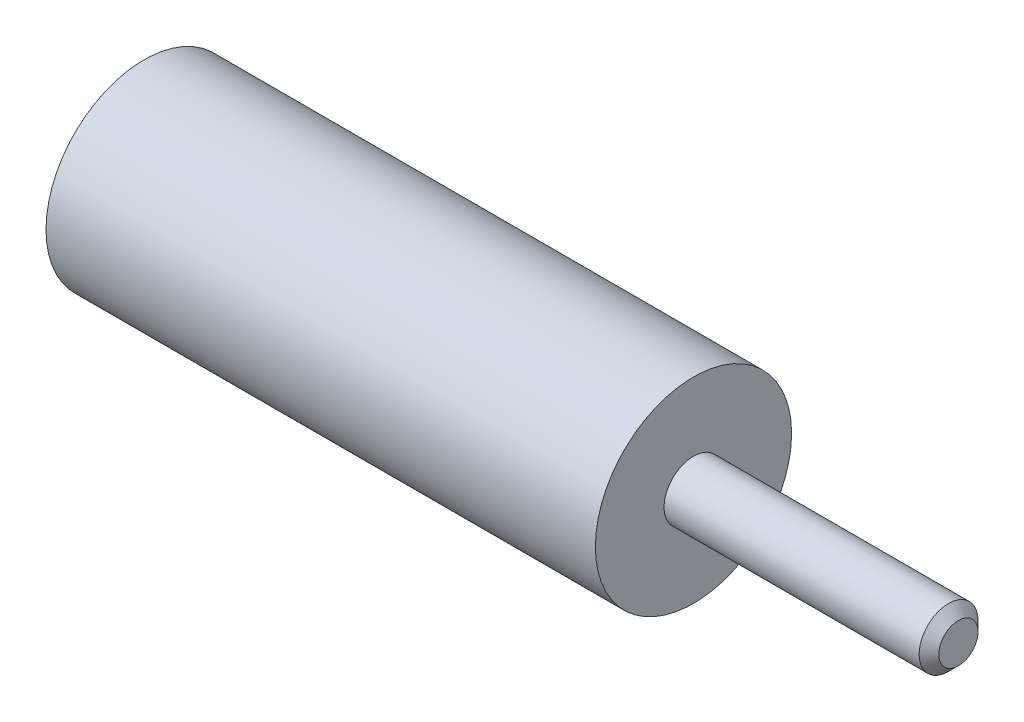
ISO-10303-21;
HEADER;
FILE_DESCRIPTION(('STEP AP214'),'2;1');
FILE_NAME('part.step','',(''),(''),'','','');
FILE_SCHEMA(('AUTOMOTIVE_DESIGN { 1 0 10303 214 1 1 1 1 }'));
ENDSEC;
DATA;
#1=APPLICATION_CONTEXT('core data for automotive mechanical design processes');
#2=APPLICATION_PROTOCOL_DEFINITION('international standard','automotive_design',2000,#1);
#3=PRODUCT_CONTEXT('',#1,'mechanical');
#4=PRODUCT('Part','Part','',(#3));
#5=PRODUCT_RELATED_PRODUCT_CATEGORY('part','',(#4));
#6=PRODUCT_DEFINITION_FORMATION('','',#4);
#7=PRODUCT_DEFINITION_CONTEXT('part definition',#1,'design');
#8=PRODUCT_DEFINITION('design','',#6,#7);
#9=PRODUCT_DEFINITION_SHAPE('','',#8);
#10=(LENGTH_UNIT() NAMED_UNIT(*) SI_UNIT(.MILLI.,.METRE.));
#11=(NAMED_UNIT(*) PLANE_ANGLE_UNIT() SI_UNIT($,.RADIAN.));
#12=(NAMED_UNIT(*) SI_UNIT($,.STERADIAN.) SOLID_ANGLE_UNIT());
#13=UNCERTAINTY_MEASURE_WITH_UNIT(LENGTH_MEASURE(1.E-05),#10,'distance_accuracy_value','');
#14=(GEOMETRIC_REPRESENTATION_CONTEXT(3) GLOBAL_UNCERTAINTY_ASSIGNED_CONTEXT((#13)) GLOBAL_UNIT_ASSIGNED_CONTEXT((#10,
#11,#12)) REPRESENTATION_CONTEXT('',''));
#15=CARTESIAN_POINT('',(0.,0.,0.));
#16=DIRECTION('',(0.,0.,1.));
#17=DIRECTION('',(1.,0.,0.));
#18=AXIS2_PLACEMENT_3D('',#15,#16,#17);
#19=CARTESIAN_POINT('',(27.,-2.,-2.));
#20=DIRECTION('',(1.,0.,0.));
#21=DIRECTION('',(0.,1.,0.));
#22=AXIS2_PLACEMENT_3D('',#19,#20,#21);
#23=PLANE('',#22);
#24=CARTESIAN_POINT('',(27.,0.,0.));
#25=DIRECTION('',(-1.,0.,0.));
#26=DIRECTION('',(0.,0.,1.));
#27=AXIS2_PLACEMENT_3D('',#24,#25,#26);
#28=CIRCLE('',#27,2.);
#29=CARTESIAN_POINT('',(27.,0.,2.));
#30=VERTEX_POINT('',#29);
#31=EDGE_CURVE('E40',#30,#30,#28,.F.);
#32=ORIENTED_EDGE('',*,*,#31,.T.);
#33=EDGE_LOOP('',(#32));
#34=FACE_BOUND('',#33,.T.);
#35=ADVANCED_FACE('F14',(#34),#23,.T.);
#36=CARTESIAN_POINT('',(-56.,10.,-10.));
#37=DIRECTION('',(-1.,0.,0.));
#38=DIRECTION('',(0.,-1.,0.));
#39=AXIS2_PLACEMENT_3D('',#36,#37,#38);
#40=PLANE('',#39);
#41=CARTESIAN_POINT('',(-56.,0.,0.));
#42=DIRECTION('',(1.,0.,0.));
#43=DIRECTION('',(0.,0.,-1.));
#44=AXIS2_PLACEMENT_3D('',#41,#42,#43);
#45=CIRCLE('',#44,10.);
#46=CARTESIAN_POINT('',(-56.,0.,-10.));
#47=VERTEX_POINT('',#46);
#48=EDGE_CURVE('E37',#47,#47,#45,.F.);
#49=ORIENTED_EDGE('',*,*,#48,.T.);
#50=EDGE_LOOP('',(#49));
#51=FACE_BOUND('',#50,.T.);
#52=ADVANCED_FACE('F49',(#51),#40,.T.);
#53=CARTESIAN_POINT('',(26.,0.,0.));
#54=DIRECTION('',(-1.,0.,0.));
#55=DIRECTION('',(0.,0.,1.));
#56=AXIS2_PLACEMENT_3D('',#53,#54,#55);
#57=CONICAL_SURFACE('',#56,3.,0.78539816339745);
#58=CARTESIAN_POINT('',(26.,0.,0.));
#59=DIRECTION('',(1.,0.,0.));
#60=DIRECTION('',(0.,1.,0.));
#61=AXIS2_PLACEMENT_3D('',#58,#59,#60);
#62=CIRCLE('',#61,3.);
#63=CARTESIAN_POINT('',(26.,3.,0.));
#64=VERTEX_POINT('',#63);
#65=EDGE_CURVE('E27',#64,#64,#62,.T.);
#66=ORIENTED_EDGE('',*,*,#65,.T.);
#67=EDGE_LOOP('',(#66));
#68=FACE_BOUND('',#67,.T.);
#69=ORIENTED_EDGE('',*,*,#31,.F.);
#70=EDGE_LOOP('',(#69));
#71=FACE_BOUND('',#70,.T.);
#72=ADVANCED_FACE('F46',(#68,#71),#57,.T.);
#73=CARTESIAN_POINT('',(-56.,0.,0.));
#74=DIRECTION('',(1.,0.,0.));
#75=DIRECTION('',(0.,0.,-1.));
#76=AXIS2_PLACEMENT_3D('',#73,#74,#75);
#77=CYLINDRICAL_SURFACE('',#76,10.);
#78=ORIENTED_EDGE('',*,*,#48,.F.);
#79=EDGE_LOOP('',(#78));
#80=FACE_BOUND('',#79,.T.);
#81=CARTESIAN_POINT('',(0.,0.,0.));
#82=DIRECTION('',(1.,0.,0.));
#83=DIRECTION('',(0.,0.,-1.));
#84=AXIS2_PLACEMENT_3D('',#81,#82,#83);
#85=CIRCLE('',#84,10.);
#86=CARTESIAN_POINT('',(0.,0.,-10.));
#87=VERTEX_POINT('',#86);
#88=EDGE_CURVE('E22',#87,#87,#85,.T.);
#89=ORIENTED_EDGE('',*,*,#88,.F.);
#90=EDGE_LOOP('',(#89));
#91=FACE_BOUND('',#90,.T.);
#92=ADVANCED_FACE('F48',(#80,#91),#77,.T.);
#93=CARTESIAN_POINT('',(0.,0.,0.));
#94=DIRECTION('',(1.,0.,0.));
#95=DIRECTION('',(0.,0.,-1.));
#96=AXIS2_PLACEMENT_3D('',#93,#94,#95);
#97=CYLINDRICAL_SURFACE('',#96,3.);
#98=CARTESIAN_POINT('',(0.,0.,0.));
#99=DIRECTION('',(1.,0.,0.));
#100=DIRECTION('',(0.,0.,-1.));
#101=AXIS2_PLACEMENT_3D('',#98,#99,#100);
#102=CIRCLE('',#101,3.);
#103=CARTESIAN_POINT('',(0.,0.,-3.));
#104=VERTEX_POINT('',#103);
#105=EDGE_CURVE('E10',#104,#104,#102,.F.);
#106=ORIENTED_EDGE('',*,*,#105,.F.);
#107=EDGE_LOOP('',(#106));
#108=FACE_BOUND('',#107,.T.);
#109=ORIENTED_EDGE('',*,*,#65,.F.);
#110=EDGE_LOOP('',(#109));
#111=FACE_BOUND('',#110,.T.);
#112=ADVANCED_FACE('F57',(#108,#111),#97,.T.);
#113=CARTESIAN_POINT('',(0.,-10.,-10.));
#114=DIRECTION('',(1.,0.,0.));
#115=DIRECTION('',(0.,1.,0.));
#116=AXIS2_PLACEMENT_3D('',#113,#114,#115);
#117=PLANE('',#116);
#118=ORIENTED_EDGE('',*,*,#105,.T.);
#119=EDGE_LOOP('',(#118));
#120=FACE_BOUND('',#119,.T.);
#121=ORIENTED_EDGE('',*,*,#88,.T.);
#122=EDGE_LOOP('',(#121));
#123=FACE_BOUND('',#122,.T.);
#124=ADVANCED_FACE('F16',(#120,#123),#117,.T.);
#125=CLOSED_SHELL('',(#35,#52,#72,#92,#112,#124));
#126=MANIFOLD_SOLID_BREP('B1',#125);
#127=ADVANCED_BREP_SHAPE_REPRESENTATION('',(#18,#126),#14);
#128=SHAPE_DEFINITION_REPRESENTATION(#9,#127);
ENDSEC;
END-ISO-10303-21;
